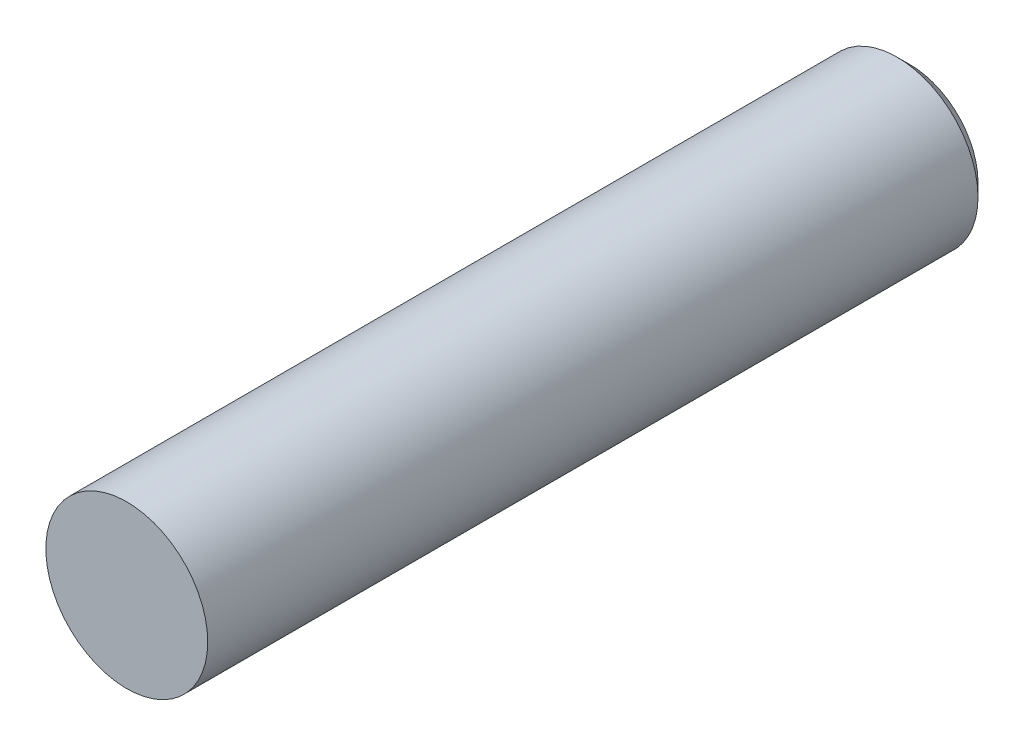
ISO-10303-21;
HEADER;
FILE_DESCRIPTION(('STEP AP214'),'2;1');
FILE_NAME('part.step','',(''),(''),'','','');
FILE_SCHEMA(('AUTOMOTIVE_DESIGN { 1 0 10303 214 1 1 1 1 }'));
ENDSEC;
DATA;
#1=APPLICATION_CONTEXT('core data for automotive mechanical design processes');
#2=APPLICATION_PROTOCOL_DEFINITION('international standard','automotive_design',2000,#1);
#3=PRODUCT_CONTEXT('',#1,'mechanical');
#4=PRODUCT('Part','Part','',(#3));
#5=PRODUCT_RELATED_PRODUCT_CATEGORY('part','',(#4));
#6=PRODUCT_DEFINITION_FORMATION('','',#4);
#7=PRODUCT_DEFINITION_CONTEXT('part definition',#1,'design');
#8=PRODUCT_DEFINITION('design','',#6,#7);
#9=PRODUCT_DEFINITION_SHAPE('','',#8);
#10=(LENGTH_UNIT() NAMED_UNIT(*) SI_UNIT(.MILLI.,.METRE.));
#11=(NAMED_UNIT(*) PLANE_ANGLE_UNIT() SI_UNIT($,.RADIAN.));
#12=(NAMED_UNIT(*) SI_UNIT($,.STERADIAN.) SOLID_ANGLE_UNIT());
#13=UNCERTAINTY_MEASURE_WITH_UNIT(LENGTH_MEASURE(1.E-05),#10,'distance_accuracy_value','');
#14=(GEOMETRIC_REPRESENTATION_CONTEXT(3) GLOBAL_UNCERTAINTY_ASSIGNED_CONTEXT((#13)) GLOBAL_UNIT_ASSIGNED_CONTEXT((#10,
#11,#12)) REPRESENTATION_CONTEXT('',''));
#15=CARTESIAN_POINT('',(0.,0.,0.));
#16=DIRECTION('',(0.,0.,1.));
#17=DIRECTION('',(1.,0.,0.));
#18=AXIS2_PLACEMENT_3D('',#15,#16,#17);
#19=CARTESIAN_POINT('',(0.,0.,30.));
#20=DIRECTION('',(0.,0.,-1.));
#21=DIRECTION('',(-1.,0.,0.));
#22=AXIS2_PLACEMENT_3D('',#19,#20,#21);
#23=CYLINDRICAL_SURFACE('',#22,3.1);
#24=CARTESIAN_POINT('',(0.,0.,0.5));
#25=DIRECTION('',(0.,0.,1.));
#26=DIRECTION('',(1.,0.,0.));
#27=AXIS2_PLACEMENT_3D('',#24,#25,#26);
#28=CIRCLE('',#27,3.1);
#29=CARTESIAN_POINT('',(3.1,0.,0.5));
#30=VERTEX_POINT('',#29);
#31=EDGE_CURVE('E30',#30,#30,#28,.T.);
#32=ORIENTED_EDGE('',*,*,#31,.T.);
#33=EDGE_LOOP('',(#32));
#34=FACE_BOUND('',#33,.T.);
#35=CARTESIAN_POINT('',(0.,0.,30.));
#36=DIRECTION('',(0.,0.,1.));
#37=DIRECTION('',(1.,0.,0.));
#38=AXIS2_PLACEMENT_3D('',#35,#36,#37);
#39=CIRCLE('',#38,3.1);
#40=CARTESIAN_POINT('',(3.1,0.,30.));
#41=VERTEX_POINT('',#40);
#42=EDGE_CURVE('E34',#41,#41,#39,.T.);
#43=ORIENTED_EDGE('',*,*,#42,.F.);
#44=EDGE_LOOP('',(#43));
#45=FACE_BOUND('',#44,.T.);
#46=ADVANCED_FACE('F24',(#34,#45),#23,.T.);
#47=CARTESIAN_POINT('',(0.,0.,30.));
#48=DIRECTION('',(0.,0.,1.));
#49=DIRECTION('',(1.,0.,0.));
#50=AXIS2_PLACEMENT_3D('',#47,#48,#49);
#51=PLANE('',#50);
#52=ORIENTED_EDGE('',*,*,#42,.T.);
#53=EDGE_LOOP('',(#52));
#54=FACE_BOUND('',#53,.T.);
#55=ADVANCED_FACE('F41',(#54),#51,.T.);
#56=CARTESIAN_POINT('',(0.,0.,0.));
#57=DIRECTION('',(0.,0.,1.));
#58=DIRECTION('',(1.,0.,0.));
#59=AXIS2_PLACEMENT_3D('',#56,#57,#58);
#60=PLANE('',#59);
#61=CARTESIAN_POINT('',(0.,0.,0.));
#62=DIRECTION('',(0.,0.,1.));
#63=DIRECTION('',(1.,0.,0.));
#64=AXIS2_PLACEMENT_3D('',#61,#62,#63);
#65=CIRCLE('',#64,2.6);
#66=CARTESIAN_POINT('',(2.6,0.,0.));
#67=VERTEX_POINT('',#66);
#68=EDGE_CURVE('E10',#67,#67,#65,.F.);
#69=ORIENTED_EDGE('',*,*,#68,.T.);
#70=EDGE_LOOP('',(#69));
#71=FACE_BOUND('',#70,.T.);
#72=ADVANCED_FACE('F48',(#71),#60,.F.);
#73=CARTESIAN_POINT('',(0.,0.,0.5));
#74=DIRECTION('',(0.,0.,1.));
#75=DIRECTION('',(1.,0.,0.));
#76=AXIS2_PLACEMENT_3D('',#73,#74,#75);
#77=CONICAL_SURFACE('',#76,3.1,0.78539816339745);
#78=ORIENTED_EDGE('',*,*,#68,.F.);
#79=EDGE_LOOP('',(#78));
#80=FACE_BOUND('',#79,.T.);
#81=ORIENTED_EDGE('',*,*,#31,.F.);
#82=EDGE_LOOP('',(#81));
#83=FACE_BOUND('',#82,.T.);
#84=ADVANCED_FACE('F51',(#80,#83),#77,.T.);
#85=CLOSED_SHELL('',(#46,#55,#72,#84));
#86=MANIFOLD_SOLID_BREP('B2',#85);
#87=ADVANCED_BREP_SHAPE_REPRESENTATION('',(#18,#86),#14);
#88=SHAPE_DEFINITION_REPRESENTATION(#9,#87);
ENDSEC;
END-ISO-10303-21;
